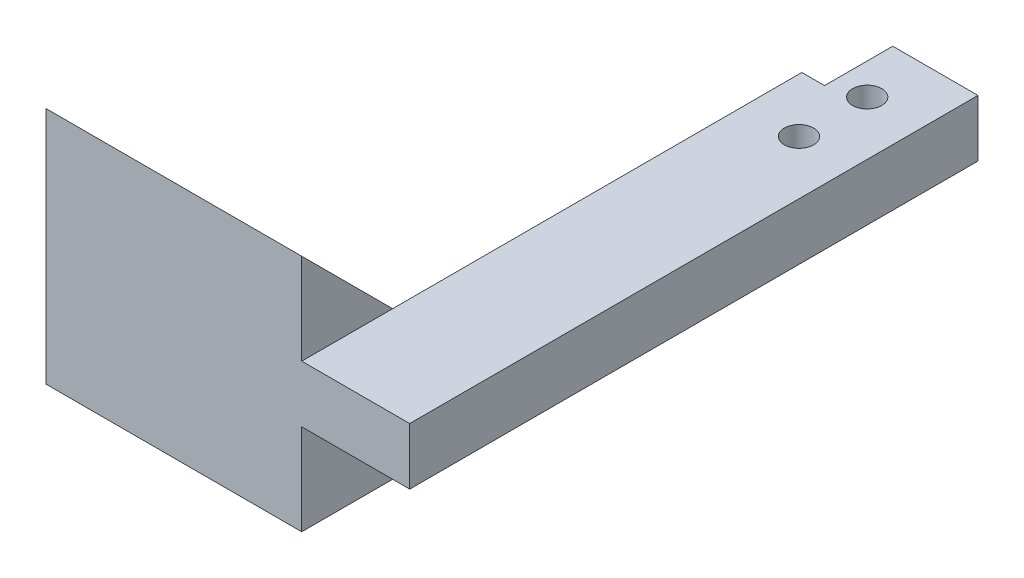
ISO-10303-21;
HEADER;
FILE_DESCRIPTION(('STEP AP214'),'2;1');
FILE_NAME('part.step','',(''),(''),'','','');
FILE_SCHEMA(('AUTOMOTIVE_DESIGN { 1 0 10303 214 1 1 1 1 }'));
ENDSEC;
DATA;
#1=APPLICATION_CONTEXT('core data for automotive mechanical design processes');
#2=APPLICATION_PROTOCOL_DEFINITION('international standard','automotive_design',2000,#1);
#3=PRODUCT_CONTEXT('',#1,'mechanical');
#4=PRODUCT('Part','Part','',(#3));
#5=PRODUCT_RELATED_PRODUCT_CATEGORY('part','',(#4));
#6=PRODUCT_DEFINITION_FORMATION('','',#4);
#7=PRODUCT_DEFINITION_CONTEXT('part definition',#1,'design');
#8=PRODUCT_DEFINITION('design','',#6,#7);
#9=PRODUCT_DEFINITION_SHAPE('','',#8);
#10=(LENGTH_UNIT() NAMED_UNIT(*) SI_UNIT(.MILLI.,.METRE.));
#11=(NAMED_UNIT(*) PLANE_ANGLE_UNIT() SI_UNIT($,.RADIAN.));
#12=(NAMED_UNIT(*) SI_UNIT($,.STERADIAN.) SOLID_ANGLE_UNIT());
#13=UNCERTAINTY_MEASURE_WITH_UNIT(LENGTH_MEASURE(1.E-05),#10,'distance_accuracy_value','');
#14=(GEOMETRIC_REPRESENTATION_CONTEXT(3) GLOBAL_UNCERTAINTY_ASSIGNED_CONTEXT((#13)) GLOBAL_UNIT_ASSIGNED_CONTEXT((#10,
#11,#12)) REPRESENTATION_CONTEXT('',''));
#15=CARTESIAN_POINT('',(0.,0.,0.));
#16=DIRECTION('',(0.,0.,1.));
#17=DIRECTION('',(1.,0.,0.));
#18=AXIS2_PLACEMENT_3D('',#15,#16,#17);
#19=CARTESIAN_POINT('',(-6.0325,6.35,31.75));
#20=DIRECTION('',(1.,0.,0.));
#21=DIRECTION('',(0.,0.,-1.));
#22=AXIS2_PLACEMENT_3D('',#19,#20,#21);
#23=PLANE('',#22);
#24=DIRECTION('',(0.,-0.707106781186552,-0.707106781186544));
#25=VECTOR('',#24,1.);
#26=CARTESIAN_POINT('',(-6.0325,16.51,31.75));
#27=LINE('',#26,#25);
#28=CARTESIAN_POINT('',(-6.0325,6.35,21.5900000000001));
#29=VERTEX_POINT('',#28);
#30=CARTESIAN_POINT('',(-6.0325,0.,15.2400000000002));
#31=VERTEX_POINT('',#30);
#32=EDGE_CURVE('E11',#29,#31,#27,.T.);
#33=ORIENTED_EDGE('',*,*,#32,.F.);
#34=DIRECTION('',(0.,0.,1.));
#35=VECTOR('',#34,1.);
#36=CARTESIAN_POINT('',(-6.0325,6.35,31.75));
#37=LINE('',#36,#35);
#38=CARTESIAN_POINT('',(-6.0325,6.35,-24.13));
#39=VERTEX_POINT('',#38);
#40=EDGE_CURVE('E200',#39,#29,#37,.T.);
#41=ORIENTED_EDGE('',*,*,#40,.F.);
#42=DIRECTION('',(0.,1.,0.));
#43=VECTOR('',#42,1.);
#44=CARTESIAN_POINT('',(-6.0325,0.,-24.13));
#45=LINE('',#44,#43);
#46=CARTESIAN_POINT('',(-6.0325,0.,-24.13));
#47=VERTEX_POINT('',#46);
#48=EDGE_CURVE('E174',#47,#39,#45,.T.);
#49=ORIENTED_EDGE('',*,*,#48,.F.);
#50=DIRECTION('',(0.,0.,1.));
#51=VECTOR('',#50,1.);
#52=CARTESIAN_POINT('',(-6.0325,0.,31.75));
#53=LINE('',#52,#51);
#54=EDGE_CURVE('E215',#47,#31,#53,.T.);
#55=ORIENTED_EDGE('',*,*,#54,.T.);
#56=EDGE_LOOP('',(#33,#41,#49,#55));
#57=FACE_BOUND('',#56,.T.);
#58=ADVANCED_FACE('F38',(#57),#23,.F.);
#59=CARTESIAN_POINT('',(6.0325,6.35,31.75));
#60=DIRECTION('',(-1.,0.,0.));
#61=DIRECTION('',(0.,0.,1.));
#62=AXIS2_PLACEMENT_3D('',#59,#60,#61);
#63=PLANE('',#62);
#64=DIRECTION('',(0.,0.,-1.));
#65=VECTOR('',#64,1.);
#66=CARTESIAN_POINT('',(6.0325,0.,31.75));
#67=LINE('',#66,#65);
#68=CARTESIAN_POINT('',(6.0325,0.,31.75));
#69=VERTEX_POINT('',#68);
#70=CARTESIAN_POINT('',(6.0325,0.,-31.75));
#71=VERTEX_POINT('',#70);
#72=EDGE_CURVE('E184',#69,#71,#67,.T.);
#73=ORIENTED_EDGE('',*,*,#72,.T.);
#74=DIRECTION('',(0.,-1.,0.));
#75=VECTOR('',#74,1.);
#76=CARTESIAN_POINT('',(6.0325,6.35,-31.75));
#77=LINE('',#76,#75);
#78=CARTESIAN_POINT('',(6.0325,6.35,-31.75));
#79=VERTEX_POINT('',#78);
#80=EDGE_CURVE('E48',#79,#71,#77,.T.);
#81=ORIENTED_EDGE('',*,*,#80,.F.);
#82=DIRECTION('',(0.,0.,-1.));
#83=VECTOR('',#82,1.);
#84=CARTESIAN_POINT('',(6.0325,6.35,31.75));
#85=LINE('',#84,#83);
#86=CARTESIAN_POINT('',(6.0325,6.35,31.75));
#87=VERTEX_POINT('',#86);
#88=EDGE_CURVE('E190',#87,#79,#85,.T.);
#89=ORIENTED_EDGE('',*,*,#88,.F.);
#90=DIRECTION('',(0.,-1.,0.));
#91=VECTOR('',#90,1.);
#92=CARTESIAN_POINT('',(6.0325,6.35,31.75));
#93=LINE('',#92,#91);
#94=EDGE_CURVE('E206',#87,#69,#93,.T.);
#95=ORIENTED_EDGE('',*,*,#94,.T.);
#96=EDGE_LOOP('',(#73,#81,#89,#95));
#97=FACE_BOUND('',#96,.T.);
#98=ADVANCED_FACE('F40',(#97),#63,.F.);
#99=CARTESIAN_POINT('',(-6.0325,6.35,-31.75));
#100=DIRECTION('',(0.,0.,1.));
#101=DIRECTION('',(1.,0.,0.));
#102=AXIS2_PLACEMENT_3D('',#99,#100,#101);
#103=PLANE('',#102);
#104=DIRECTION('',(-1.,0.,0.));
#105=VECTOR('',#104,1.);
#106=CARTESIAN_POINT('',(-6.0325,0.,-31.75));
#107=LINE('',#106,#105);
#108=CARTESIAN_POINT('',(-3.4925,0.,-31.75));
#109=VERTEX_POINT('',#108);
#110=EDGE_CURVE('E210',#71,#109,#107,.T.);
#111=ORIENTED_EDGE('',*,*,#110,.T.);
#112=DIRECTION('',(0.,1.,0.));
#113=VECTOR('',#112,1.);
#114=CARTESIAN_POINT('',(-3.4925,0.,-31.75));
#115=LINE('',#114,#113);
#116=CARTESIAN_POINT('',(-3.4925,6.35,-31.75));
#117=VERTEX_POINT('',#116);
#118=EDGE_CURVE('E180',#109,#117,#115,.T.);
#119=ORIENTED_EDGE('',*,*,#118,.T.);
#120=DIRECTION('',(-1.,0.,0.));
#121=VECTOR('',#120,1.);
#122=CARTESIAN_POINT('',(-6.0325,6.35,-31.75));
#123=LINE('',#122,#121);
#124=EDGE_CURVE('E194',#79,#117,#123,.T.);
#125=ORIENTED_EDGE('',*,*,#124,.F.);
#126=ORIENTED_EDGE('',*,*,#80,.T.);
#127=EDGE_LOOP('',(#111,#119,#125,#126));
#128=FACE_BOUND('',#127,.T.);
#129=ADVANCED_FACE('F227',(#128),#103,.F.);
#130=CARTESIAN_POINT('',(-6.0325,6.35,31.75));
#131=DIRECTION('',(0.,0.,-1.));
#132=DIRECTION('',(-1.,0.,0.));
#133=AXIS2_PLACEMENT_3D('',#130,#131,#132);
#134=PLANE('',#133);
#135=DIRECTION('',(1.,0.,0.));
#136=VECTOR('',#135,1.);
#137=CARTESIAN_POINT('',(-6.0325,0.,31.75));
#138=LINE('',#137,#136);
#139=CARTESIAN_POINT('',(-6.0325,0.,31.75));
#140=VERTEX_POINT('',#139);
#141=EDGE_CURVE('E195',#140,#69,#138,.T.);
#142=ORIENTED_EDGE('',*,*,#141,.T.);
#143=ORIENTED_EDGE('',*,*,#94,.F.);
#144=DIRECTION('',(1.,0.,0.));
#145=VECTOR('',#144,1.);
#146=CARTESIAN_POINT('',(-6.0325,6.35,31.75));
#147=LINE('',#146,#145);
#148=CARTESIAN_POINT('',(-6.0325,6.35,31.75));
#149=VERTEX_POINT('',#148);
#150=EDGE_CURVE('E203',#149,#87,#147,.T.);
#151=ORIENTED_EDGE('',*,*,#150,.F.);
#152=DIRECTION('',(0.,1.,0.));
#153=VECTOR('',#152,1.);
#154=CARTESIAN_POINT('',(-6.0325,6.35,31.75));
#155=LINE('',#154,#153);
#156=CARTESIAN_POINT('',(-6.0325,16.51,31.75));
#157=VERTEX_POINT('',#156);
#158=EDGE_CURVE('E137',#149,#157,#155,.T.);
#159=ORIENTED_EDGE('',*,*,#158,.T.);
#160=DIRECTION('',(1.,0.,0.));
#161=VECTOR('',#160,1.);
#162=CARTESIAN_POINT('',(-34.6075,16.51,31.75));
#163=LINE('',#162,#161);
#164=CARTESIAN_POINT('',(-34.6075,16.51,31.75));
#165=VERTEX_POINT('',#164);
#166=EDGE_CURVE('E133',#165,#157,#163,.T.);
#167=ORIENTED_EDGE('',*,*,#166,.F.);
#168=DIRECTION('',(0.,1.,0.));
#169=VECTOR('',#168,1.);
#170=CARTESIAN_POINT('',(-34.6075,-10.16,31.75));
#171=LINE('',#170,#169);
#172=CARTESIAN_POINT('',(-34.6075,-10.16,31.75));
#173=VERTEX_POINT('',#172);
#174=EDGE_CURVE('E118',#173,#165,#171,.T.);
#175=ORIENTED_EDGE('',*,*,#174,.F.);
#176=DIRECTION('',(1.,0.,0.));
#177=VECTOR('',#176,1.);
#178=CARTESIAN_POINT('',(-34.6075,-10.16,31.75));
#179=LINE('',#178,#177);
#180=CARTESIAN_POINT('',(-6.0325,-10.16,31.75));
#181=VERTEX_POINT('',#180);
#182=EDGE_CURVE('E151',#173,#181,#179,.T.);
#183=ORIENTED_EDGE('',*,*,#182,.T.);
#184=EDGE_CURVE('E155',#181,#140,#155,.T.);
#185=ORIENTED_EDGE('',*,*,#184,.T.);
#186=EDGE_LOOP('',(#142,#143,#151,#159,#167,#175,#183,#185));
#187=FACE_BOUND('',#186,.T.);
#188=ADVANCED_FACE('F134',(#187),#134,.F.);
#189=CARTESIAN_POINT('',(0.,6.35,0.));
#190=DIRECTION('',(0.,-1.,0.));
#191=DIRECTION('',(0.,0.,-1.));
#192=AXIS2_PLACEMENT_3D('',#189,#190,#191);
#193=PLANE('',#192);
#194=CARTESIAN_POINT('',(0.,6.35,-25.4));
#195=DIRECTION('',(0.,1.,0.));
#196=DIRECTION('',(0.,0.,1.));
#197=AXIS2_PLACEMENT_3D('',#194,#195,#196);
#198=CIRCLE('',#197,1.63195);
#199=CARTESIAN_POINT('',(0.,6.35,-23.76805));
#200=VERTEX_POINT('',#199);
#201=EDGE_CURVE('E286',#200,#200,#198,.T.);
#202=ORIENTED_EDGE('',*,*,#201,.F.);
#203=EDGE_LOOP('',(#202));
#204=FACE_BOUND('',#203,.T.);
#205=CARTESIAN_POINT('',(0.,6.35,-17.78));
#206=DIRECTION('',(0.,1.,0.));
#207=DIRECTION('',(0.,0.,1.));
#208=AXIS2_PLACEMENT_3D('',#205,#206,#207);
#209=CIRCLE('',#208,1.63195);
#210=CARTESIAN_POINT('',(0.,6.35,-16.14805));
#211=VERTEX_POINT('',#210);
#212=EDGE_CURVE('E289',#211,#211,#209,.T.);
#213=ORIENTED_EDGE('',*,*,#212,.F.);
#214=EDGE_LOOP('',(#213));
#215=FACE_BOUND('',#214,.T.);
#216=ORIENTED_EDGE('',*,*,#124,.T.);
#217=DIRECTION('',(0.,0.,-1.));
#218=VECTOR('',#217,1.);
#219=CARTESIAN_POINT('',(-3.4925,6.35,-31.75));
#220=LINE('',#219,#218);
#221=CARTESIAN_POINT('',(-3.4925,6.35,-24.13));
#222=VERTEX_POINT('',#221);
#223=EDGE_CURVE('E171',#222,#117,#220,.T.);
#224=ORIENTED_EDGE('',*,*,#223,.F.);
#225=DIRECTION('',(1.,0.,0.));
#226=VECTOR('',#225,1.);
#227=CARTESIAN_POINT('',(-6.0325,6.35,-24.13));
#228=LINE('',#227,#226);
#229=EDGE_CURVE('E142',#39,#222,#228,.T.);
#230=ORIENTED_EDGE('',*,*,#229,.F.);
#231=ORIENTED_EDGE('',*,*,#40,.T.);
#232=EDGE_CURVE('E199',#29,#149,#37,.T.);
#233=ORIENTED_EDGE('',*,*,#232,.T.);
#234=ORIENTED_EDGE('',*,*,#150,.T.);
#235=ORIENTED_EDGE('',*,*,#88,.T.);
#236=EDGE_LOOP('',(#216,#224,#230,#231,#233,#234,#235));
#237=FACE_BOUND('',#236,.T.);
#238=ADVANCED_FACE('F243',(#204,#215,#237),#193,.F.);
#239=CARTESIAN_POINT('',(0.,0.,0.));
#240=DIRECTION('',(0.,-1.,0.));
#241=DIRECTION('',(0.,0.,-1.));
#242=AXIS2_PLACEMENT_3D('',#239,#240,#241);
#243=PLANE('',#242);
#244=CARTESIAN_POINT('',(0.,0.,-25.4));
#245=DIRECTION('',(0.,-1.,0.));
#246=DIRECTION('',(0.,0.,-1.));
#247=AXIS2_PLACEMENT_3D('',#244,#245,#246);
#248=CIRCLE('',#247,1.63195);
#249=CARTESIAN_POINT('',(0.,0.,-27.03195));
#250=VERTEX_POINT('',#249);
#251=EDGE_CURVE('E292',#250,#250,#248,.T.);
#252=ORIENTED_EDGE('',*,*,#251,.F.);
#253=EDGE_LOOP('',(#252));
#254=FACE_BOUND('',#253,.T.);
#255=CARTESIAN_POINT('',(0.,0.,-17.78));
#256=DIRECTION('',(0.,-1.,0.));
#257=DIRECTION('',(0.,0.,-1.));
#258=AXIS2_PLACEMENT_3D('',#255,#256,#257);
#259=CIRCLE('',#258,1.63195);
#260=CARTESIAN_POINT('',(0.,0.,-19.41195));
#261=VERTEX_POINT('',#260);
#262=EDGE_CURVE('E42',#261,#261,#259,.T.);
#263=ORIENTED_EDGE('',*,*,#262,.F.);
#264=EDGE_LOOP('',(#263));
#265=FACE_BOUND('',#264,.T.);
#266=DIRECTION('',(0.,0.,-1.));
#267=VECTOR('',#266,1.);
#268=CARTESIAN_POINT('',(-3.4925,0.,-31.75));
#269=LINE('',#268,#267);
#270=CARTESIAN_POINT('',(-3.4925,0.,-24.13));
#271=VERTEX_POINT('',#270);
#272=EDGE_CURVE('E64',#271,#109,#269,.T.);
#273=ORIENTED_EDGE('',*,*,#272,.T.);
#274=ORIENTED_EDGE('',*,*,#110,.F.);
#275=ORIENTED_EDGE('',*,*,#72,.F.);
#276=ORIENTED_EDGE('',*,*,#141,.F.);
#277=EDGE_CURVE('E214',#31,#140,#53,.T.);
#278=ORIENTED_EDGE('',*,*,#277,.F.);
#279=ORIENTED_EDGE('',*,*,#54,.F.);
#280=DIRECTION('',(1.,0.,0.));
#281=VECTOR('',#280,1.);
#282=CARTESIAN_POINT('',(-6.0325,0.,-24.13));
#283=LINE('',#282,#281);
#284=EDGE_CURVE('E167',#47,#271,#283,.T.);
#285=ORIENTED_EDGE('',*,*,#284,.T.);
#286=EDGE_LOOP('',(#273,#274,#275,#276,#278,#279,#285));
#287=FACE_BOUND('',#286,.T.);
#288=ADVANCED_FACE('F233',(#254,#265,#287),#243,.T.);
#289=CARTESIAN_POINT('',(-3.4925,0.,-31.75));
#290=DIRECTION('',(1.,0.,0.));
#291=DIRECTION('',(0.,0.,-1.));
#292=AXIS2_PLACEMENT_3D('',#289,#290,#291);
#293=PLANE('',#292);
#294=ORIENTED_EDGE('',*,*,#223,.T.);
#295=ORIENTED_EDGE('',*,*,#118,.F.);
#296=ORIENTED_EDGE('',*,*,#272,.F.);
#297=DIRECTION('',(0.,1.,0.));
#298=VECTOR('',#297,1.);
#299=CARTESIAN_POINT('',(-3.4925,0.,-24.13));
#300=LINE('',#299,#298);
#301=EDGE_CURVE('E185',#271,#222,#300,.T.);
#302=ORIENTED_EDGE('',*,*,#301,.T.);
#303=EDGE_LOOP('',(#294,#295,#296,#302));
#304=FACE_BOUND('',#303,.T.);
#305=ADVANCED_FACE('F255',(#304),#293,.F.);
#306=CARTESIAN_POINT('',(-6.0325,0.,-24.13));
#307=DIRECTION('',(0.,0.,1.));
#308=DIRECTION('',(1.,0.,0.));
#309=AXIS2_PLACEMENT_3D('',#306,#307,#308);
#310=PLANE('',#309);
#311=ORIENTED_EDGE('',*,*,#229,.T.);
#312=ORIENTED_EDGE('',*,*,#301,.F.);
#313=ORIENTED_EDGE('',*,*,#284,.F.);
#314=ORIENTED_EDGE('',*,*,#48,.T.);
#315=EDGE_LOOP('',(#311,#312,#313,#314));
#316=FACE_BOUND('',#315,.T.);
#317=ADVANCED_FACE('F239',(#316),#310,.F.);
#318=CARTESIAN_POINT('',(-6.0325,0.,0.));
#319=DIRECTION('',(1.,0.,0.));
#320=DIRECTION('',(0.,0.,-1.));
#321=AXIS2_PLACEMENT_3D('',#318,#319,#320);
#322=PLANE('',#321);
#323=ORIENTED_EDGE('',*,*,#232,.F.);
#324=EDGE_CURVE('E50',#157,#29,#27,.T.);
#325=ORIENTED_EDGE('',*,*,#324,.F.);
#326=ORIENTED_EDGE('',*,*,#158,.F.);
#327=EDGE_LOOP('',(#323,#325,#326));
#328=FACE_BOUND('',#327,.T.);
#329=ADVANCED_FACE('F246',(#328),#322,.T.);
#330=CARTESIAN_POINT('',(-34.6075,16.51,31.75));
#331=DIRECTION('',(0.,-0.707106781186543,0.707106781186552));
#332=DIRECTION('',(0.,-0.707106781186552,-0.707106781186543));
#333=AXIS2_PLACEMENT_3D('',#330,#331,#332);
#334=PLANE('',#333);
#335=ORIENTED_EDGE('',*,*,#324,.T.);
#336=ORIENTED_EDGE('',*,*,#32,.T.);
#337=CARTESIAN_POINT('',(-6.0325,-10.16,5.0800000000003));
#338=VERTEX_POINT('',#337);
#339=EDGE_CURVE('E51',#31,#338,#27,.T.);
#340=ORIENTED_EDGE('',*,*,#339,.T.);
#341=DIRECTION('',(1.,0.,0.));
#342=VECTOR('',#341,1.);
#343=CARTESIAN_POINT('',(-34.6075,-10.16,5.0800000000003));
#344=LINE('',#343,#342);
#345=CARTESIAN_POINT('',(-34.6075,-10.16,5.0800000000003));
#346=VERTEX_POINT('',#345);
#347=EDGE_CURVE('E143',#346,#338,#344,.T.);
#348=ORIENTED_EDGE('',*,*,#347,.F.);
#349=DIRECTION('',(0.,-0.707106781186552,-0.707106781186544));
#350=VECTOR('',#349,1.);
#351=CARTESIAN_POINT('',(-34.6075,16.51,31.75));
#352=LINE('',#351,#350);
#353=EDGE_CURVE('E122',#165,#346,#352,.T.);
#354=ORIENTED_EDGE('',*,*,#353,.F.);
#355=ORIENTED_EDGE('',*,*,#166,.T.);
#356=EDGE_LOOP('',(#335,#336,#340,#348,#354,#355));
#357=FACE_BOUND('',#356,.T.);
#358=ADVANCED_FACE('F145',(#357),#334,.F.);
#359=CARTESIAN_POINT('',(-34.6075,-10.16,5.0800000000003));
#360=DIRECTION('',(0.,1.,0.));
#361=DIRECTION('',(0.,0.,1.));
#362=AXIS2_PLACEMENT_3D('',#359,#360,#361);
#363=PLANE('',#362);
#364=DIRECTION('',(0.,0.,1.));
#365=VECTOR('',#364,1.);
#366=CARTESIAN_POINT('',(-6.0325,-10.16,5.0800000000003));
#367=LINE('',#366,#365);
#368=EDGE_CURVE('E130',#338,#181,#367,.T.);
#369=ORIENTED_EDGE('',*,*,#368,.T.);
#370=ORIENTED_EDGE('',*,*,#182,.F.);
#371=DIRECTION('',(0.,0.,1.));
#372=VECTOR('',#371,1.);
#373=CARTESIAN_POINT('',(-34.6075,-10.16,5.0800000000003));
#374=LINE('',#373,#372);
#375=EDGE_CURVE('E125',#346,#173,#374,.T.);
#376=ORIENTED_EDGE('',*,*,#375,.F.);
#377=ORIENTED_EDGE('',*,*,#347,.T.);
#378=EDGE_LOOP('',(#369,#370,#376,#377));
#379=FACE_BOUND('',#378,.T.);
#380=ADVANCED_FACE('F253',(#379),#363,.F.);
#381=CARTESIAN_POINT('',(-34.6075,0.,0.));
#382=DIRECTION('',(1.,0.,0.));
#383=DIRECTION('',(0.,0.,-1.));
#384=AXIS2_PLACEMENT_3D('',#381,#382,#383);
#385=PLANE('',#384);
#386=ORIENTED_EDGE('',*,*,#174,.T.);
#387=ORIENTED_EDGE('',*,*,#353,.T.);
#388=ORIENTED_EDGE('',*,*,#375,.T.);
#389=EDGE_LOOP('',(#386,#387,#388));
#390=FACE_BOUND('',#389,.T.);
#391=ADVANCED_FACE('F120',(#390),#385,.F.);
#392=ORIENTED_EDGE('',*,*,#339,.F.);
#393=ORIENTED_EDGE('',*,*,#277,.T.);
#394=ORIENTED_EDGE('',*,*,#184,.F.);
#395=ORIENTED_EDGE('',*,*,#368,.F.);
#396=EDGE_LOOP('',(#392,#393,#394,#395));
#397=FACE_BOUND('',#396,.T.);
#398=ADVANCED_FACE('F254',(#397),#322,.T.);
#399=CARTESIAN_POINT('',(0.,6.35,-17.78));
#400=DIRECTION('',(0.,1.,0.));
#401=DIRECTION('',(0.,0.,1.));
#402=AXIS2_PLACEMENT_3D('',#399,#400,#401);
#403=CYLINDRICAL_SURFACE('',#402,1.63195);
#404=ORIENTED_EDGE('',*,*,#262,.T.);
#405=EDGE_LOOP('',(#404));
#406=FACE_BOUND('',#405,.T.);
#407=ORIENTED_EDGE('',*,*,#212,.T.);
#408=EDGE_LOOP('',(#407));
#409=FACE_BOUND('',#408,.T.);
#410=ADVANCED_FACE('F305',(#406,#409),#403,.F.);
#411=CARTESIAN_POINT('',(0.,6.35,-25.4));
#412=DIRECTION('',(0.,1.,0.));
#413=DIRECTION('',(0.,0.,1.));
#414=AXIS2_PLACEMENT_3D('',#411,#412,#413);
#415=CYLINDRICAL_SURFACE('',#414,1.63195);
#416=ORIENTED_EDGE('',*,*,#251,.T.);
#417=EDGE_LOOP('',(#416));
#418=FACE_BOUND('',#417,.T.);
#419=ORIENTED_EDGE('',*,*,#201,.T.);
#420=EDGE_LOOP('',(#419));
#421=FACE_BOUND('',#420,.T.);
#422=ADVANCED_FACE('F303',(#418,#421),#415,.F.);
#423=CLOSED_SHELL('',(#58,#98,#129,#188,#238,#288,#305,#317,#329,#358,#380,#391,#398,#410,#422));
#424=MANIFOLD_SOLID_BREP('B2',#423);
#425=ADVANCED_BREP_SHAPE_REPRESENTATION('',(#18,#424),#14);
#426=SHAPE_DEFINITION_REPRESENTATION(#9,#425);
ENDSEC;
END-ISO-10303-21;
